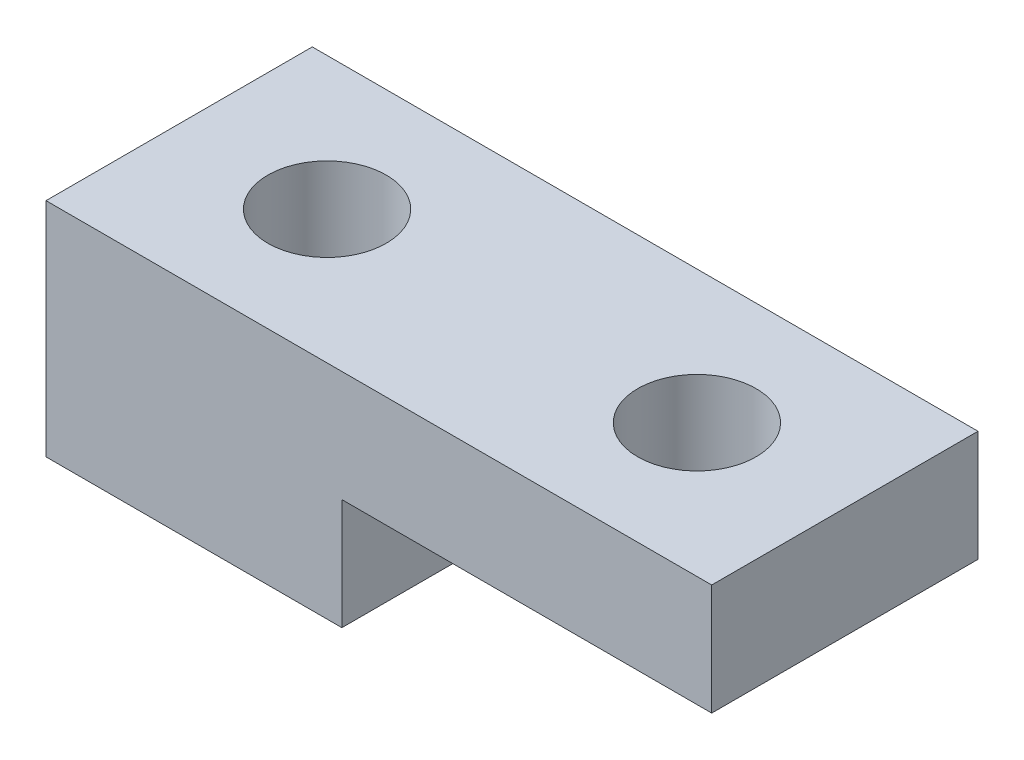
ISO-10303-21;
HEADER;
FILE_DESCRIPTION(('STEP AP214'),'2;1');
FILE_NAME('part.step','',(''),(''),'','','');
FILE_SCHEMA(('AUTOMOTIVE_DESIGN { 1 0 10303 214 1 1 1 1 }'));
ENDSEC;
DATA;
#1=APPLICATION_CONTEXT('core data for automotive mechanical design processes');
#2=APPLICATION_PROTOCOL_DEFINITION('international standard','automotive_design',2000,#1);
#3=PRODUCT_CONTEXT('',#1,'mechanical');
#4=PRODUCT('Part','Part','',(#3));
#5=PRODUCT_RELATED_PRODUCT_CATEGORY('part','',(#4));
#6=PRODUCT_DEFINITION_FORMATION('','',#4);
#7=PRODUCT_DEFINITION_CONTEXT('part definition',#1,'design');
#8=PRODUCT_DEFINITION('design','',#6,#7);
#9=PRODUCT_DEFINITION_SHAPE('','',#8);
#10=(LENGTH_UNIT() NAMED_UNIT(*) SI_UNIT(.MILLI.,.METRE.));
#11=(NAMED_UNIT(*) PLANE_ANGLE_UNIT() SI_UNIT($,.RADIAN.));
#12=(NAMED_UNIT(*) SI_UNIT($,.STERADIAN.) SOLID_ANGLE_UNIT());
#13=UNCERTAINTY_MEASURE_WITH_UNIT(LENGTH_MEASURE(1.E-05),#10,'distance_accuracy_value','');
#14=(GEOMETRIC_REPRESENTATION_CONTEXT(3) GLOBAL_UNCERTAINTY_ASSIGNED_CONTEXT((#13)) GLOBAL_UNIT_ASSIGNED_CONTEXT((#10,
#11,#12)) REPRESENTATION_CONTEXT('',''));
#15=CARTESIAN_POINT('',(0.,0.,0.));
#16=DIRECTION('',(0.,0.,1.));
#17=DIRECTION('',(1.,0.,0.));
#18=AXIS2_PLACEMENT_3D('',#15,#16,#17);
#19=CARTESIAN_POINT('',(20.,0.,9.));
#20=DIRECTION('',(0.,1.,0.));
#21=DIRECTION('',(-1.,0.,0.));
#22=AXIS2_PLACEMENT_3D('',#19,#20,#21);
#23=PLANE('',#22);
#24=CARTESIAN_POINT('',(10.,0.,0.));
#25=DIRECTION('',(0.,1.,0.));
#26=DIRECTION('',(0.,0.,1.));
#27=AXIS2_PLACEMENT_3D('',#24,#25,#26);
#28=CIRCLE('',#27,4.);
#29=CARTESIAN_POINT('',(10.,0.,4.));
#30=VERTEX_POINT('',#29);
#31=EDGE_CURVE('E98',#30,#30,#28,.T.);
#32=ORIENTED_EDGE('',*,*,#31,.T.);
#33=EDGE_LOOP('',(#32));
#34=FACE_BOUND('',#33,.T.);
#35=DIRECTION('',(1.,0.,0.));
#36=VECTOR('',#35,1.);
#37=CARTESIAN_POINT('',(20.,0.,-9.));
#38=LINE('',#37,#36);
#39=CARTESIAN_POINT('',(0.,0.,-9.));
#40=VERTEX_POINT('',#39);
#41=CARTESIAN_POINT('',(20.,0.,-9.));
#42=VERTEX_POINT('',#41);
#43=EDGE_CURVE('E84',#40,#42,#38,.T.);
#44=ORIENTED_EDGE('',*,*,#43,.T.);
#45=DIRECTION('',(0.,0.,-1.));
#46=VECTOR('',#45,1.);
#47=CARTESIAN_POINT('',(20.,0.,9.));
#48=LINE('',#47,#46);
#49=CARTESIAN_POINT('',(20.,0.,9.));
#50=VERTEX_POINT('',#49);
#51=EDGE_CURVE('E11',#50,#42,#48,.T.);
#52=ORIENTED_EDGE('',*,*,#51,.F.);
#53=DIRECTION('',(1.,0.,0.));
#54=VECTOR('',#53,1.);
#55=CARTESIAN_POINT('',(20.,0.,9.));
#56=LINE('',#55,#54);
#57=CARTESIAN_POINT('',(0.,0.,9.));
#58=VERTEX_POINT('',#57);
#59=EDGE_CURVE('E112',#58,#50,#56,.T.);
#60=ORIENTED_EDGE('',*,*,#59,.F.);
#61=DIRECTION('',(0.,0.,-1.));
#62=VECTOR('',#61,1.);
#63=CARTESIAN_POINT('',(0.,0.,9.));
#64=LINE('',#63,#62);
#65=EDGE_CURVE('E97',#58,#40,#64,.T.);
#66=ORIENTED_EDGE('',*,*,#65,.T.);
#67=EDGE_LOOP('',(#44,#52,#60,#66));
#68=FACE_BOUND('',#67,.T.);
#69=ADVANCED_FACE('F28',(#34,#68),#23,.F.);
#70=CARTESIAN_POINT('',(20.,7.5,9.));
#71=DIRECTION('',(-1.,0.,0.));
#72=DIRECTION('',(0.,-1.,0.));
#73=AXIS2_PLACEMENT_3D('',#70,#71,#72);
#74=PLANE('',#73);
#75=DIRECTION('',(0.,1.,0.));
#76=VECTOR('',#75,1.);
#77=CARTESIAN_POINT('',(20.,7.5,-9.));
#78=LINE('',#77,#76);
#79=CARTESIAN_POINT('',(20.,7.5,-9.));
#80=VERTEX_POINT('',#79);
#81=EDGE_CURVE('E80',#42,#80,#78,.T.);
#82=ORIENTED_EDGE('',*,*,#81,.T.);
#83=DIRECTION('',(0.,0.,-1.));
#84=VECTOR('',#83,1.);
#85=CARTESIAN_POINT('',(20.,7.5,9.));
#86=LINE('',#85,#84);
#87=CARTESIAN_POINT('',(20.,7.5,9.));
#88=VERTEX_POINT('',#87);
#89=EDGE_CURVE('E35',#88,#80,#86,.T.);
#90=ORIENTED_EDGE('',*,*,#89,.F.);
#91=DIRECTION('',(0.,1.,0.));
#92=VECTOR('',#91,1.);
#93=CARTESIAN_POINT('',(20.,7.5,9.));
#94=LINE('',#93,#92);
#95=EDGE_CURVE('E93',#50,#88,#94,.T.);
#96=ORIENTED_EDGE('',*,*,#95,.F.);
#97=ORIENTED_EDGE('',*,*,#51,.T.);
#98=EDGE_LOOP('',(#82,#90,#96,#97));
#99=FACE_BOUND('',#98,.T.);
#100=ADVANCED_FACE('F92',(#99),#74,.F.);
#101=CARTESIAN_POINT('',(45.,7.5,9.));
#102=DIRECTION('',(0.,1.,0.));
#103=DIRECTION('',(-1.,0.,0.));
#104=AXIS2_PLACEMENT_3D('',#101,#102,#103);
#105=PLANE('',#104);
#106=CARTESIAN_POINT('',(35.,7.5,0.));
#107=DIRECTION('',(0.,1.,0.));
#108=DIRECTION('',(-1.,0.,0.));
#109=AXIS2_PLACEMENT_3D('',#106,#107,#108);
#110=CIRCLE('',#109,4.);
#111=CARTESIAN_POINT('',(35.,7.5,4.));
#112=VERTEX_POINT('',#111);
#113=EDGE_CURVE('E171',#112,#112,#110,.T.);
#114=ORIENTED_EDGE('',*,*,#113,.T.);
#115=EDGE_LOOP('',(#114));
#116=FACE_BOUND('',#115,.T.);
#117=DIRECTION('',(1.,0.,0.));
#118=VECTOR('',#117,1.);
#119=CARTESIAN_POINT('',(45.,7.5,-9.));
#120=LINE('',#119,#118);
#121=CARTESIAN_POINT('',(45.,7.5,-9.));
#122=VERTEX_POINT('',#121);
#123=EDGE_CURVE('E86',#80,#122,#120,.T.);
#124=ORIENTED_EDGE('',*,*,#123,.T.);
#125=DIRECTION('',(0.,0.,-1.));
#126=VECTOR('',#125,1.);
#127=CARTESIAN_POINT('',(45.,7.5,9.));
#128=LINE('',#127,#126);
#129=CARTESIAN_POINT('',(45.,7.5,9.));
#130=VERTEX_POINT('',#129);
#131=EDGE_CURVE('E128',#130,#122,#128,.T.);
#132=ORIENTED_EDGE('',*,*,#131,.F.);
#133=DIRECTION('',(1.,0.,0.));
#134=VECTOR('',#133,1.);
#135=CARTESIAN_POINT('',(45.,7.5,9.));
#136=LINE('',#135,#134);
#137=EDGE_CURVE('E115',#88,#130,#136,.T.);
#138=ORIENTED_EDGE('',*,*,#137,.F.);
#139=ORIENTED_EDGE('',*,*,#89,.T.);
#140=EDGE_LOOP('',(#124,#132,#138,#139));
#141=FACE_BOUND('',#140,.T.);
#142=ADVANCED_FACE('F132',(#116,#141),#105,.F.);
#143=CARTESIAN_POINT('',(45.,15.,9.));
#144=DIRECTION('',(-1.,0.,0.));
#145=DIRECTION('',(0.,0.,1.));
#146=AXIS2_PLACEMENT_3D('',#143,#144,#145);
#147=PLANE('',#146);
#148=DIRECTION('',(0.,1.,0.));
#149=VECTOR('',#148,1.);
#150=CARTESIAN_POINT('',(45.,15.,-9.));
#151=LINE('',#150,#149);
#152=CARTESIAN_POINT('',(45.,15.,-9.));
#153=VERTEX_POINT('',#152);
#154=EDGE_CURVE('E106',#122,#153,#151,.T.);
#155=ORIENTED_EDGE('',*,*,#154,.T.);
#156=DIRECTION('',(0.,0.,-1.));
#157=VECTOR('',#156,1.);
#158=CARTESIAN_POINT('',(45.,15.,9.));
#159=LINE('',#158,#157);
#160=CARTESIAN_POINT('',(45.,15.,9.));
#161=VERTEX_POINT('',#160);
#162=EDGE_CURVE('E125',#161,#153,#159,.T.);
#163=ORIENTED_EDGE('',*,*,#162,.F.);
#164=DIRECTION('',(0.,1.,0.));
#165=VECTOR('',#164,1.);
#166=CARTESIAN_POINT('',(45.,15.,9.));
#167=LINE('',#166,#165);
#168=EDGE_CURVE('E117',#130,#161,#167,.T.);
#169=ORIENTED_EDGE('',*,*,#168,.F.);
#170=ORIENTED_EDGE('',*,*,#131,.T.);
#171=EDGE_LOOP('',(#155,#163,#169,#170));
#172=FACE_BOUND('',#171,.T.);
#173=ADVANCED_FACE('F138',(#172),#147,.F.);
#174=CARTESIAN_POINT('',(0.,15.,9.));
#175=DIRECTION('',(0.,-1.,0.));
#176=DIRECTION('',(0.,0.,-1.));
#177=AXIS2_PLACEMENT_3D('',#174,#175,#176);
#178=PLANE('',#177);
#179=CARTESIAN_POINT('',(35.,15.,0.));
#180=DIRECTION('',(0.,1.,0.));
#181=DIRECTION('',(0.,0.,1.));
#182=AXIS2_PLACEMENT_3D('',#179,#180,#181);
#183=CIRCLE('',#182,4.);
#184=CARTESIAN_POINT('',(35.,15.,4.));
#185=VERTEX_POINT('',#184);
#186=EDGE_CURVE('E173',#185,#185,#183,.T.);
#187=ORIENTED_EDGE('',*,*,#186,.F.);
#188=EDGE_LOOP('',(#187));
#189=FACE_BOUND('',#188,.T.);
#190=CARTESIAN_POINT('',(10.,15.,0.));
#191=DIRECTION('',(0.,1.,0.));
#192=DIRECTION('',(0.,0.,1.));
#193=AXIS2_PLACEMENT_3D('',#190,#191,#192);
#194=CIRCLE('',#193,4.);
#195=CARTESIAN_POINT('',(10.,15.,4.));
#196=VERTEX_POINT('',#195);
#197=EDGE_CURVE('E101',#196,#196,#194,.T.);
#198=ORIENTED_EDGE('',*,*,#197,.F.);
#199=EDGE_LOOP('',(#198));
#200=FACE_BOUND('',#199,.T.);
#201=DIRECTION('',(-1.,0.,0.));
#202=VECTOR('',#201,1.);
#203=CARTESIAN_POINT('',(0.,15.,-9.));
#204=LINE('',#203,#202);
#205=CARTESIAN_POINT('',(0.,15.,-9.));
#206=VERTEX_POINT('',#205);
#207=EDGE_CURVE('E108',#153,#206,#204,.T.);
#208=ORIENTED_EDGE('',*,*,#207,.T.);
#209=DIRECTION('',(0.,0.,-1.));
#210=VECTOR('',#209,1.);
#211=CARTESIAN_POINT('',(0.,15.,9.));
#212=LINE('',#211,#210);
#213=CARTESIAN_POINT('',(0.,15.,9.));
#214=VERTEX_POINT('',#213);
#215=EDGE_CURVE('E122',#214,#206,#212,.T.);
#216=ORIENTED_EDGE('',*,*,#215,.F.);
#217=DIRECTION('',(-1.,0.,0.));
#218=VECTOR('',#217,1.);
#219=CARTESIAN_POINT('',(0.,15.,9.));
#220=LINE('',#219,#218);
#221=EDGE_CURVE('E47',#161,#214,#220,.T.);
#222=ORIENTED_EDGE('',*,*,#221,.F.);
#223=ORIENTED_EDGE('',*,*,#162,.T.);
#224=EDGE_LOOP('',(#208,#216,#222,#223));
#225=FACE_BOUND('',#224,.T.);
#226=ADVANCED_FACE('F141',(#189,#200,#225),#178,.F.);
#227=CARTESIAN_POINT('',(0.,0.,9.));
#228=DIRECTION('',(1.,0.,0.));
#229=DIRECTION('',(0.,0.,-1.));
#230=AXIS2_PLACEMENT_3D('',#227,#228,#229);
#231=PLANE('',#230);
#232=DIRECTION('',(0.,-1.,0.));
#233=VECTOR('',#232,1.);
#234=CARTESIAN_POINT('',(0.,0.,-9.));
#235=LINE('',#234,#233);
#236=EDGE_CURVE('E110',#206,#40,#235,.T.);
#237=ORIENTED_EDGE('',*,*,#236,.T.);
#238=ORIENTED_EDGE('',*,*,#65,.F.);
#239=DIRECTION('',(0.,-1.,0.));
#240=VECTOR('',#239,1.);
#241=CARTESIAN_POINT('',(0.,0.,9.));
#242=LINE('',#241,#240);
#243=EDGE_CURVE('E42',#214,#58,#242,.T.);
#244=ORIENTED_EDGE('',*,*,#243,.F.);
#245=ORIENTED_EDGE('',*,*,#215,.T.);
#246=EDGE_LOOP('',(#237,#238,#244,#245));
#247=FACE_BOUND('',#246,.T.);
#248=ADVANCED_FACE('F143',(#247),#231,.F.);
#249=CARTESIAN_POINT('',(0.,0.,9.));
#250=DIRECTION('',(0.,0.,-1.));
#251=DIRECTION('',(-1.,0.,0.));
#252=AXIS2_PLACEMENT_3D('',#249,#250,#251);
#253=PLANE('',#252);
#254=ORIENTED_EDGE('',*,*,#59,.T.);
#255=ORIENTED_EDGE('',*,*,#95,.T.);
#256=ORIENTED_EDGE('',*,*,#137,.T.);
#257=ORIENTED_EDGE('',*,*,#168,.T.);
#258=ORIENTED_EDGE('',*,*,#221,.T.);
#259=ORIENTED_EDGE('',*,*,#243,.T.);
#260=EDGE_LOOP('',(#254,#255,#256,#257,#258,#259));
#261=FACE_BOUND('',#260,.T.);
#262=ADVANCED_FACE('F135',(#261),#253,.F.);
#263=CARTESIAN_POINT('',(0.,0.,-9.));
#264=DIRECTION('',(0.,0.,-1.));
#265=DIRECTION('',(-1.,0.,0.));
#266=AXIS2_PLACEMENT_3D('',#263,#264,#265);
#267=PLANE('',#266);
#268=ORIENTED_EDGE('',*,*,#43,.F.);
#269=ORIENTED_EDGE('',*,*,#236,.F.);
#270=ORIENTED_EDGE('',*,*,#207,.F.);
#271=ORIENTED_EDGE('',*,*,#154,.F.);
#272=ORIENTED_EDGE('',*,*,#123,.F.);
#273=ORIENTED_EDGE('',*,*,#81,.F.);
#274=EDGE_LOOP('',(#268,#269,#270,#271,#272,#273));
#275=FACE_BOUND('',#274,.T.);
#276=ADVANCED_FACE('F81',(#275),#267,.T.);
#277=CARTESIAN_POINT('',(10.,0.,0.));
#278=DIRECTION('',(0.,1.,0.));
#279=DIRECTION('',(0.,0.,1.));
#280=AXIS2_PLACEMENT_3D('',#277,#278,#279);
#281=CYLINDRICAL_SURFACE('',#280,4.);
#282=CARTESIAN_POINT('',(10.,0.,4.));
#283=CARTESIAN_POINT('',(10.,0.156249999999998,4.));
#284=CARTESIAN_POINT('',(10.,0.312499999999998,4.));
#285=CARTESIAN_POINT('',(10.,0.624999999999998,4.));
#286=CARTESIAN_POINT('',(10.,0.781249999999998,4.));
#287=CARTESIAN_POINT('',(10.,1.09375,4.));
#288=CARTESIAN_POINT('',(10.,1.25,4.));
#289=CARTESIAN_POINT('',(10.,1.5625,4.));
#290=CARTESIAN_POINT('',(10.,1.71875,4.));
#291=CARTESIAN_POINT('',(10.,2.03125,4.));
#292=CARTESIAN_POINT('',(10.,2.1875,4.));
#293=CARTESIAN_POINT('',(10.,2.5,4.));
#294=CARTESIAN_POINT('',(10.,2.65625,4.));
#295=CARTESIAN_POINT('',(10.,2.96875,4.));
#296=CARTESIAN_POINT('',(10.,3.125,4.));
#297=CARTESIAN_POINT('',(10.,3.4375,4.));
#298=CARTESIAN_POINT('',(10.,3.59375,4.));
#299=CARTESIAN_POINT('',(10.,3.90625,4.));
#300=CARTESIAN_POINT('',(10.,4.0625,4.));
#301=CARTESIAN_POINT('',(10.,4.375,4.));
#302=CARTESIAN_POINT('',(10.,4.53125,4.));
#303=CARTESIAN_POINT('',(10.,4.84375,4.));
#304=CARTESIAN_POINT('',(10.,5.,4.));
#305=CARTESIAN_POINT('',(10.,5.3125,4.));
#306=CARTESIAN_POINT('',(10.,5.46875,4.));
#307=CARTESIAN_POINT('',(10.,5.78125,4.));
#308=CARTESIAN_POINT('',(10.,5.9375,4.));
#309=CARTESIAN_POINT('',(10.,6.25,4.));
#310=CARTESIAN_POINT('',(10.,6.40625,4.));
#311=CARTESIAN_POINT('',(10.,6.71875,4.));
#312=CARTESIAN_POINT('',(10.,6.875,4.));
#313=CARTESIAN_POINT('',(10.,7.1875,4.));
#314=CARTESIAN_POINT('',(10.,7.34375,4.));
#315=CARTESIAN_POINT('',(10.,7.65625,4.));
#316=CARTESIAN_POINT('',(10.,7.8125,4.));
#317=CARTESIAN_POINT('',(10.,8.125,4.));
#318=CARTESIAN_POINT('',(10.,8.28125,4.));
#319=CARTESIAN_POINT('',(10.,8.59375,4.));
#320=CARTESIAN_POINT('',(10.,8.75,4.));
#321=CARTESIAN_POINT('',(10.,9.0625,4.));
#322=CARTESIAN_POINT('',(10.,9.21875,4.));
#323=CARTESIAN_POINT('',(10.,9.53125,4.));
#324=CARTESIAN_POINT('',(10.,9.6875,4.));
#325=CARTESIAN_POINT('',(10.,10.,4.));
#326=CARTESIAN_POINT('',(10.,10.15625,4.));
#327=CARTESIAN_POINT('',(10.,10.46875,4.));
#328=CARTESIAN_POINT('',(10.,10.625,4.));
#329=CARTESIAN_POINT('',(10.,10.9375,4.));
#330=CARTESIAN_POINT('',(10.,11.09375,4.));
#331=CARTESIAN_POINT('',(10.,11.40625,4.));
#332=CARTESIAN_POINT('',(10.,11.5625,4.));
#333=CARTESIAN_POINT('',(10.,11.875,4.));
#334=CARTESIAN_POINT('',(10.,12.03125,4.));
#335=CARTESIAN_POINT('',(10.,12.34375,4.));
#336=CARTESIAN_POINT('',(10.,12.5,4.));
#337=CARTESIAN_POINT('',(10.,12.8125,4.));
#338=CARTESIAN_POINT('',(10.,12.96875,4.));
#339=CARTESIAN_POINT('',(10.,13.28125,4.));
#340=CARTESIAN_POINT('',(10.,13.4375,4.));
#341=CARTESIAN_POINT('',(10.,13.75,4.));
#342=CARTESIAN_POINT('',(10.,13.90625,4.));
#343=CARTESIAN_POINT('',(10.,14.21875,4.));
#344=CARTESIAN_POINT('',(10.,14.375,4.));
#345=CARTESIAN_POINT('',(10.,14.6875,4.));
#346=CARTESIAN_POINT('',(10.,14.84375,4.));
#347=CARTESIAN_POINT('',(10.,15.,4.));
#348=B_SPLINE_CURVE_WITH_KNOTS('',3,(#282,#283,#284,#285,#286,#287,#288,#289,#290,#291,#292,
#293,#294,#295,#296,#297,#298,#299,#300,#301,#302,#303,#304,#305,#306,#307,#308,#309,#310,#311,
#312,#313,#314,#315,#316,#317,#318,#319,#320,#321,#322,#323,#324,#325,#326,#327,#328,#329,#330,
#331,#332,#333,#334,#335,#336,#337,#338,#339,#340,#341,#342,#343,#344,#345,#346,#347),
.UNSPECIFIED.,.F.,.F.,(4,2,2,2,2,2,2,2,2,2,2,2,2,2,2,2,2,2,2,2,2,2,2,2,2,2,2,2,2,2,2,2,4),(0.,
0.46875,0.9375,1.40625,1.875,2.34375,2.8125,3.28125,3.75,4.21875,4.6875,5.15625,5.625,6.09375,
6.5625,7.03125,7.5,7.96875,8.4375,8.90625,9.375,9.84375,10.3125,10.78125,11.25,11.71875,12.1875,
12.65625,13.125,13.59375,14.0625,14.53125,15.),.UNSPECIFIED.);
#349=EDGE_CURVE('BSEAM163',#30,#196,#348,.T.);
#350=ORIENTED_EDGE('',*,*,#31,.F.);
#351=ORIENTED_EDGE('',*,*,#197,.T.);
#352=ORIENTED_EDGE('',*,*,#349,.T.);
#353=ORIENTED_EDGE('',*,*,#349,.F.);
#354=EDGE_LOOP('',(#350,#352,#351,#353));
#355=FACE_BOUND('',#354,.T.);
#356=ADVANCED_FACE('F163',(#355),#281,.F.);
#357=CARTESIAN_POINT('',(35.,0.,0.));
#358=DIRECTION('',(0.,1.,0.));
#359=DIRECTION('',(0.,0.,1.));
#360=AXIS2_PLACEMENT_3D('',#357,#358,#359);
#361=CYLINDRICAL_SURFACE('',#360,4.);
#362=CARTESIAN_POINT('',(35.,15.,4.));
#363=CARTESIAN_POINT('',(35.,14.921875,4.));
#364=CARTESIAN_POINT('',(35.,14.84375,4.));
#365=CARTESIAN_POINT('',(35.,14.6875,4.));
#366=CARTESIAN_POINT('',(35.,14.609375,4.));
#367=CARTESIAN_POINT('',(35.,14.453125,4.));
#368=CARTESIAN_POINT('',(35.,14.375,4.));
#369=CARTESIAN_POINT('',(35.,14.21875,4.));
#370=CARTESIAN_POINT('',(35.,14.140625,4.));
#371=CARTESIAN_POINT('',(35.,13.984375,4.));
#372=CARTESIAN_POINT('',(35.,13.90625,4.));
#373=CARTESIAN_POINT('',(35.,13.75,4.));
#374=CARTESIAN_POINT('',(35.,13.671875,4.));
#375=CARTESIAN_POINT('',(35.,13.515625,4.));
#376=CARTESIAN_POINT('',(35.,13.4375,4.));
#377=CARTESIAN_POINT('',(35.,13.28125,4.));
#378=CARTESIAN_POINT('',(35.,13.203125,4.));
#379=CARTESIAN_POINT('',(35.,13.046875,4.));
#380=CARTESIAN_POINT('',(35.,12.96875,4.));
#381=CARTESIAN_POINT('',(35.,12.8125,4.));
#382=CARTESIAN_POINT('',(35.,12.734375,4.));
#383=CARTESIAN_POINT('',(35.,12.578125,4.));
#384=CARTESIAN_POINT('',(35.,12.5,4.));
#385=CARTESIAN_POINT('',(35.,12.34375,4.));
#386=CARTESIAN_POINT('',(35.,12.265625,4.));
#387=CARTESIAN_POINT('',(35.,12.109375,4.));
#388=CARTESIAN_POINT('',(35.,12.03125,4.));
#389=CARTESIAN_POINT('',(35.,11.875,4.));
#390=CARTESIAN_POINT('',(35.,11.796875,4.));
#391=CARTESIAN_POINT('',(35.,11.640625,4.));
#392=CARTESIAN_POINT('',(35.,11.5625,4.));
#393=CARTESIAN_POINT('',(35.,11.40625,4.));
#394=CARTESIAN_POINT('',(35.,11.328125,4.));
#395=CARTESIAN_POINT('',(35.,11.171875,4.));
#396=CARTESIAN_POINT('',(35.,11.09375,4.));
#397=CARTESIAN_POINT('',(35.,10.9375,4.));
#398=CARTESIAN_POINT('',(35.,10.859375,4.));
#399=CARTESIAN_POINT('',(35.,10.703125,4.));
#400=CARTESIAN_POINT('',(35.,10.625,4.));
#401=CARTESIAN_POINT('',(35.,10.46875,4.));
#402=CARTESIAN_POINT('',(35.,10.390625,4.));
#403=CARTESIAN_POINT('',(35.,10.234375,4.));
#404=CARTESIAN_POINT('',(35.,10.15625,4.));
#405=CARTESIAN_POINT('',(35.,10.,4.));
#406=CARTESIAN_POINT('',(35.,9.921875,4.));
#407=CARTESIAN_POINT('',(35.,9.765625,4.));
#408=CARTESIAN_POINT('',(35.,9.6875,4.));
#409=CARTESIAN_POINT('',(35.,9.53125,4.));
#410=CARTESIAN_POINT('',(35.,9.453125,4.));
#411=CARTESIAN_POINT('',(35.,9.296875,4.));
#412=CARTESIAN_POINT('',(35.,9.21875,4.));
#413=CARTESIAN_POINT('',(35.,9.0625,4.));
#414=CARTESIAN_POINT('',(35.,8.984375,4.));
#415=CARTESIAN_POINT('',(35.,8.828125,4.));
#416=CARTESIAN_POINT('',(35.,8.75,4.));
#417=CARTESIAN_POINT('',(35.,8.59375,4.));
#418=CARTESIAN_POINT('',(35.,8.515625,4.));
#419=CARTESIAN_POINT('',(35.,8.359375,4.));
#420=CARTESIAN_POINT('',(35.,8.28125,4.));
#421=CARTESIAN_POINT('',(35.,8.125,4.));
#422=CARTESIAN_POINT('',(35.,8.046875,4.));
#423=CARTESIAN_POINT('',(35.,7.890625,4.));
#424=CARTESIAN_POINT('',(35.,7.8125,4.));
#425=CARTESIAN_POINT('',(35.,7.65625,4.));
#426=CARTESIAN_POINT('',(35.,7.578125,4.));
#427=CARTESIAN_POINT('',(35.,7.5,4.));
#428=B_SPLINE_CURVE_WITH_KNOTS('',3,(#362,#363,#364,#365,#366,#367,#368,#369,#370,#371,#372,
#373,#374,#375,#376,#377,#378,#379,#380,#381,#382,#383,#384,#385,#386,#387,#388,#389,#390,#391,
#392,#393,#394,#395,#396,#397,#398,#399,#400,#401,#402,#403,#404,#405,#406,#407,#408,#409,#410,
#411,#412,#413,#414,#415,#416,#417,#418,#419,#420,#421,#422,#423,#424,#425,#426,#427),
.UNSPECIFIED.,.F.,.F.,(4,2,2,2,2,2,2,2,2,2,2,2,2,2,2,2,2,2,2,2,2,2,2,2,2,2,2,2,2,2,2,2,4),(0.,
0.234375,0.46875,0.703125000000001,0.937500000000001,1.171875,1.40625,1.640625,1.875,2.109375,
2.34375,2.578125,2.8125,3.046875,3.28125,3.515625,3.75,3.984375,4.21875,4.453125,4.6875,
4.921875,5.15625,5.390625,5.625,5.859375,6.09375,6.328125,6.5625,6.796875,7.03125,7.265625,7.5),.UNSPECIFIED.);
#429=EDGE_CURVE('BSEAM166',#185,#112,#428,.T.);
#430=ORIENTED_EDGE('',*,*,#186,.T.);
#431=ORIENTED_EDGE('',*,*,#113,.F.);
#432=ORIENTED_EDGE('',*,*,#429,.T.);
#433=ORIENTED_EDGE('',*,*,#429,.F.);
#434=EDGE_LOOP('',(#430,#432,#431,#433));
#435=FACE_BOUND('',#434,.T.);
#436=ADVANCED_FACE('F166',(#435),#361,.F.);
#437=CLOSED_SHELL('',(#69,#100,#142,#173,#226,#248,#262,#276,#356,#436));
#438=MANIFOLD_SOLID_BREP('B2',#437);
#439=ADVANCED_BREP_SHAPE_REPRESENTATION('',(#18,#438),#14);
#440=SHAPE_DEFINITION_REPRESENTATION(#9,#439);
ENDSEC;
END-ISO-10303-21;
